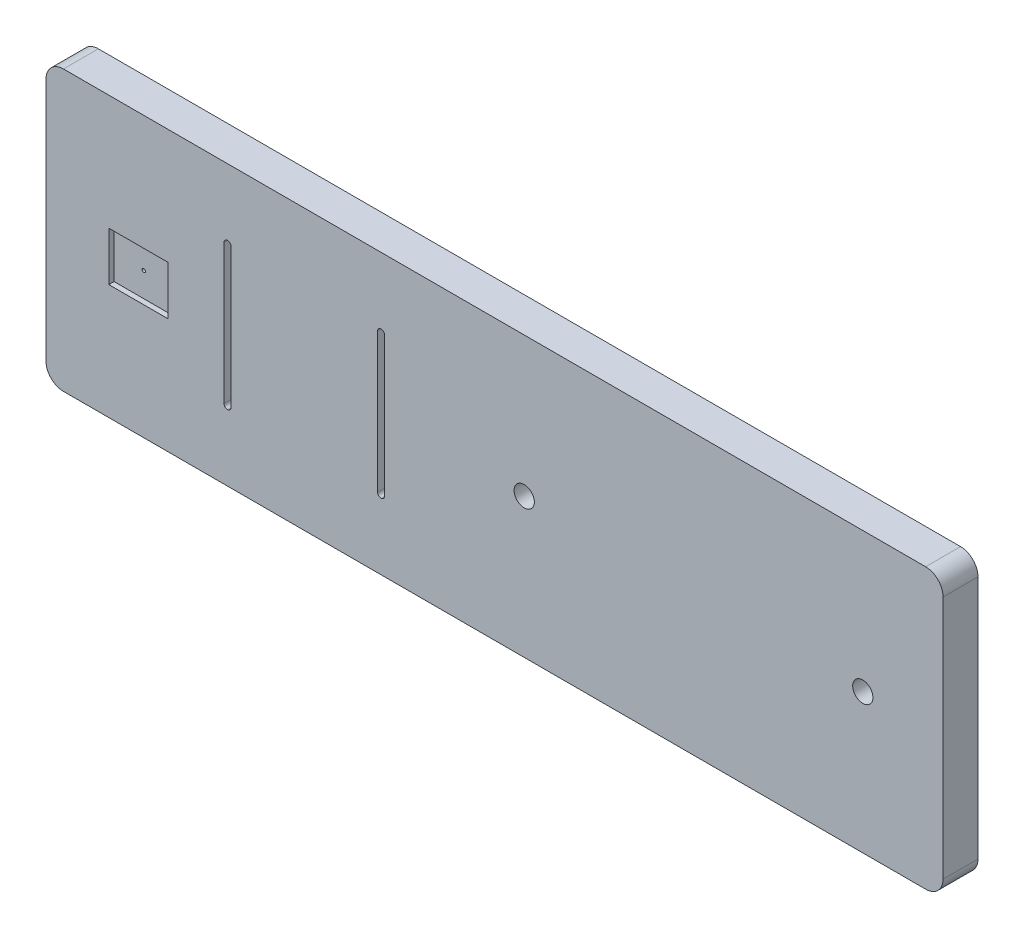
from build123d import *

# Parameters (mm, degrees)
ESQUISSE1_R             = 2.9
EXTRUSION1_DEPTH        = 10
ENL_V_MAT_EXTRU_1_DEPTH = 5
ESQUISSE4_W             = 17
ESQUISSE4_H             = 14
ENL_V_MAT_EXTRU_2_DEPTH = 1.5
ESQUISSE5_R             = 0.5
ENL_V_MAT_EXTRU_3_DEPTH = 2


with BuildPart() as part:
    # Esquisse1 → Extrusion1 (new body)
    with BuildSketch(Plane.XY):
        with BuildLine():
            Line((115, 40), (-132, 40))
            ThreePointArc((-132, 40), (-135.535533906, 38.535533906), (-137, 35))
            Line((-137, 35), (-137, -35))
            ThreePointArc((-137, -35), (-135.535533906, -38.535533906), (-132, -40))
            Line((-132, -40), (115, -40))
            ThreePointArc((115, -40), (118.535533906, -38.535533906), (120, -35))
            Line((120, -35), (120, 35))
            ThreePointArc((120, 35), (118.535533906, 38.535533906), (115, 40))
        make_face()
        with Locations((97, 0)):
            Circle(ESQUISSE1_R, mode=Mode.SUBTRACT)
        Circle(ESQUISSE1_R, mode=Mode.SUBTRACT)
    extrude(amount=EXTRUSION1_DEPTH)

    # Esquisse2 → Enl_v. mat.-Extru.1 (cut)
    with BuildSketch(Plane.XY.offset(10)):
        with BuildLine():
            Line((-85.01, 20.99), (-84.99, 20.99))
            ThreePointArc((-84.99, 20.99), (-84.289964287, 20.700035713), (-84, 20))
            Line((-84, 20), (-84, -20))
            ThreePointArc((-84, -20), (-84.289964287, -20.700035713), (-84.99, -20.99))
            Line((-84.99, -20.99), (-85.01, -20.99))
            ThreePointArc((-85.01, -20.99), (-85.710035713, -20.700035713), (-86, -20))
            Line((-86, -20), (-86, 20))
            ThreePointArc((-86, 20), (-85.710035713, 20.700035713), (-85.01, 20.99))
        make_face()
        with BuildLine():
            Line((-41.01, 20.99), (-40.99, 20.99))
            ThreePointArc((-40.99, 20.99), (-40.289964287, 20.700035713), (-40, 20))
            Line((-40, 20), (-40, -20))
            ThreePointArc((-40, -20), (-40.289964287, -20.700035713), (-40.99, -20.99))
            Line((-40.99, -20.99), (-41.01, -20.99))
            ThreePointArc((-41.01, -20.99), (-41.710035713, -20.700035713), (-42, -20))
            Line((-42, -20), (-42, 20))
            ThreePointArc((-42, 20), (-41.710035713, 20.700035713), (-41.01, 20.99))
        make_face()
    extrude(amount=-ENL_V_MAT_EXTRU_1_DEPTH, mode=Mode.SUBTRACT)

    # Esquisse4 → Enl_v. mat.-Extru.2 (cut)
    with BuildSketch(Plane.XY.offset(10)):
        with Locations((-110.5, 0)):
            Rectangle(ESQUISSE4_W, ESQUISSE4_H)
    extrude(amount=-ENL_V_MAT_EXTRU_2_DEPTH, mode=Mode.SUBTRACT)

    # Esquisse5 → Enl_v. mat.-Extru.3 (cut)
    with BuildSketch(Plane.XY.offset(8.5)):
        with Locations((-110.5, 0)):
            Circle(ESQUISSE5_R)
    extrude(amount=-ENL_V_MAT_EXTRU_3_DEPTH, mode=Mode.SUBTRACT)


solid = part.part
